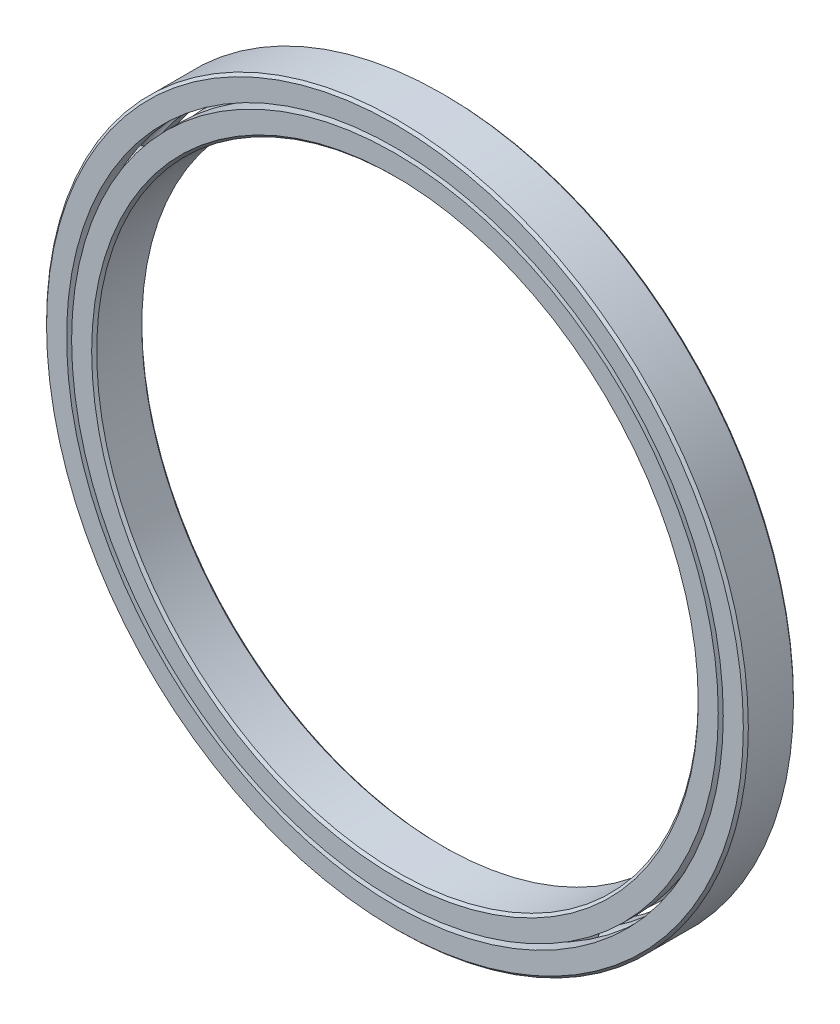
ISO-10303-21;
HEADER;
FILE_DESCRIPTION(('STEP AP214'),'2;1');
FILE_NAME('part.step','',(''),(''),'','','');
FILE_SCHEMA(('AUTOMOTIVE_DESIGN { 1 0 10303 214 1 1 1 1 }'));
ENDSEC;
DATA;
#1=APPLICATION_CONTEXT('core data for automotive mechanical design processes');
#2=APPLICATION_PROTOCOL_DEFINITION('international standard','automotive_design',2000,#1);
#3=PRODUCT_CONTEXT('',#1,'mechanical');
#4=PRODUCT('Part','Part','',(#3));
#5=PRODUCT_RELATED_PRODUCT_CATEGORY('part','',(#4));
#6=PRODUCT_DEFINITION_FORMATION('','',#4);
#7=PRODUCT_DEFINITION_CONTEXT('part definition',#1,'design');
#8=PRODUCT_DEFINITION('design','',#6,#7);
#9=PRODUCT_DEFINITION_SHAPE('','',#8);
#10=(LENGTH_UNIT() NAMED_UNIT(*) SI_UNIT(.MILLI.,.METRE.));
#11=(NAMED_UNIT(*) PLANE_ANGLE_UNIT() SI_UNIT($,.RADIAN.));
#12=(NAMED_UNIT(*) SI_UNIT($,.STERADIAN.) SOLID_ANGLE_UNIT());
#13=UNCERTAINTY_MEASURE_WITH_UNIT(LENGTH_MEASURE(1.E-05),#10,'distance_accuracy_value','');
#14=(GEOMETRIC_REPRESENTATION_CONTEXT(3) GLOBAL_UNCERTAINTY_ASSIGNED_CONTEXT((#13)) GLOBAL_UNIT_ASSIGNED_CONTEXT((#10,
#11,#12)) REPRESENTATION_CONTEXT('',''));
#15=CARTESIAN_POINT('',(0.,0.,0.));
#16=DIRECTION('',(0.,0.,1.));
#17=DIRECTION('',(1.,0.,0.));
#18=AXIS2_PLACEMENT_3D('',#15,#16,#17);
#19=CARTESIAN_POINT('',(-20.6374999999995,35.745198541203,0.));
#20=DIRECTION('',(0.,0.,1.));
#21=DIRECTION('',(-0.499999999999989,0.866025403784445,0.));
#22=AXIS2_PLACEMENT_3D('',#19,#20,#21);
#23=SPHERICAL_SURFACE('',#22,1.44638888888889);
#24=CARTESIAN_POINT('',(-20.6374999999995,35.745198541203,1.44638888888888));
#25=VERTEX_POINT('',#24);
#26=VERTEX_LOOP('',#25);
#27=FACE_BOUND('',#26,.T.);
#28=ADVANCED_FACE('F43',(#27),#23,.T.);
#29=CLOSED_SHELL('',(#28));
#30=MANIFOLD_SOLID_BREP('B2',#29);
#31=CARTESIAN_POINT('',(-35.7451985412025,20.6375000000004,0.));
#32=DIRECTION('',(0.,0.,1.));
#33=DIRECTION('',(-0.866025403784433,0.50000000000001,0.));
#34=AXIS2_PLACEMENT_3D('',#31,#32,#33);
#35=SPHERICAL_SURFACE('',#34,1.44638888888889);
#36=CARTESIAN_POINT('',(-35.7451985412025,20.6375000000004,1.44638888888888));
#37=VERTEX_POINT('',#36);
#38=VERTEX_LOOP('',#37);
#39=FACE_BOUND('',#38,.T.);
#40=ADVANCED_FACE('F63',(#39),#35,.T.);
#41=CLOSED_SHELL('',(#40));
#42=MANIFOLD_SOLID_BREP('B6',#41);
#43=CARTESIAN_POINT('',(-41.275,4.32332927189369E-13,0.));
#44=DIRECTION('',(0.,0.,1.));
#45=DIRECTION('',(-1.,0.,0.));
#46=AXIS2_PLACEMENT_3D('',#43,#44,#45);
#47=SPHERICAL_SURFACE('',#46,1.44638888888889);
#48=CARTESIAN_POINT('',(-41.275,4.32332927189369E-13,1.44638888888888));
#49=VERTEX_POINT('',#48);
#50=VERTEX_LOOP('',#49);
#51=FACE_BOUND('',#50,.T.);
#52=ADVANCED_FACE('F83',(#51),#47,.T.);
#53=CLOSED_SHELL('',(#52));
#54=MANIFOLD_SOLID_BREP('B39',#53);
#55=CARTESIAN_POINT('',(-35.7451985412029,-20.6374999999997,0.));
#56=DIRECTION('',(0.,0.,1.));
#57=DIRECTION('',(-0.866025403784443,-0.499999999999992,0.));
#58=AXIS2_PLACEMENT_3D('',#55,#56,#57);
#59=SPHERICAL_SURFACE('',#58,1.44638888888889);
#60=CARTESIAN_POINT('',(-35.7451985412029,-20.6374999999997,1.44638888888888));
#61=VERTEX_POINT('',#60);
#62=VERTEX_LOOP('',#61);
#63=FACE_BOUND('',#62,.T.);
#64=ADVANCED_FACE('F103',(#63),#59,.T.);
#65=CLOSED_SHELL('',(#64));
#66=MANIFOLD_SOLID_BREP('B59',#65);
#67=CARTESIAN_POINT('',(-20.6375000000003,-35.7451985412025,0.));
#68=DIRECTION('',(0.,0.,1.));
#69=DIRECTION('',(-0.500000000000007,-0.866025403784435,0.));
#70=AXIS2_PLACEMENT_3D('',#67,#68,#69);
#71=SPHERICAL_SURFACE('',#70,1.44638888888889);
#72=CARTESIAN_POINT('',(-20.6375000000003,-35.7451985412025,1.44638888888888));
#73=VERTEX_POINT('',#72);
#74=VERTEX_LOOP('',#73);
#75=FACE_BOUND('',#74,.T.);
#76=ADVANCED_FACE('F123',(#75),#71,.T.);
#77=CLOSED_SHELL('',(#76));
#78=MANIFOLD_SOLID_BREP('B79',#77);
#79=CARTESIAN_POINT('',(-2.88221951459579E-13,-41.275,0.));
#80=DIRECTION('',(0.,0.,1.));
#81=DIRECTION('',(0.,-1.,0.));
#82=AXIS2_PLACEMENT_3D('',#79,#80,#81);
#83=SPHERICAL_SURFACE('',#82,1.44638888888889);
#84=CARTESIAN_POINT('',(-2.88221951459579E-13,-41.275,1.44638888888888));
#85=VERTEX_POINT('',#84);
#86=VERTEX_LOOP('',#85);
#87=FACE_BOUND('',#86,.T.);
#88=ADVANCED_FACE('F143',(#87),#83,.T.);
#89=CLOSED_SHELL('',(#88));
#90=MANIFOLD_SOLID_BREP('B99',#89);
#91=CARTESIAN_POINT('',(20.6374999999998,-35.7451985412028,0.));
#92=DIRECTION('',(0.,0.,1.));
#93=DIRECTION('',(0.499999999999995,-0.866025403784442,0.));
#94=AXIS2_PLACEMENT_3D('',#91,#92,#93);
#95=SPHERICAL_SURFACE('',#94,1.44638888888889);
#96=CARTESIAN_POINT('',(20.6374999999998,-35.7451985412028,1.44638888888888));
#97=VERTEX_POINT('',#96);
#98=VERTEX_LOOP('',#97);
#99=FACE_BOUND('',#98,.T.);
#100=ADVANCED_FACE('F163',(#99),#95,.T.);
#101=CLOSED_SHELL('',(#100));
#102=MANIFOLD_SOLID_BREP('B119',#101);
#103=CARTESIAN_POINT('',(35.7451985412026,-20.6375000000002,0.));
#104=DIRECTION('',(0.,0.,1.));
#105=DIRECTION('',(0.866025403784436,-0.500000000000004,0.));
#106=AXIS2_PLACEMENT_3D('',#103,#104,#105);
#107=SPHERICAL_SURFACE('',#106,1.44638888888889);
#108=CARTESIAN_POINT('',(35.7451985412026,-20.6375000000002,1.44638888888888));
#109=VERTEX_POINT('',#108);
#110=VERTEX_LOOP('',#109);
#111=FACE_BOUND('',#110,.T.);
#112=ADVANCED_FACE('F183',(#111),#107,.T.);
#113=CLOSED_SHELL('',(#112));
#114=MANIFOLD_SOLID_BREP('B139',#113);
#115=CARTESIAN_POINT('',(41.275,-1.4411097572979E-13,0.));
#116=DIRECTION('',(0.,0.,1.));
#117=DIRECTION('',(1.,0.,0.));
#118=AXIS2_PLACEMENT_3D('',#115,#116,#117);
#119=SPHERICAL_SURFACE('',#118,1.44638888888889);
#120=CARTESIAN_POINT('',(41.275,-1.4411097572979E-13,1.44638888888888));
#121=VERTEX_POINT('',#120);
#122=VERTEX_LOOP('',#121);
#123=FACE_BOUND('',#122,.T.);
#124=ADVANCED_FACE('F203',(#123),#119,.T.);
#125=CLOSED_SHELL('',(#124));
#126=MANIFOLD_SOLID_BREP('B159',#125);
#127=CARTESIAN_POINT('',(35.7451985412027,20.6374999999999,0.));
#128=DIRECTION('',(0.,0.,1.));
#129=DIRECTION('',(0.86602540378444,0.499999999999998,0.));
#130=AXIS2_PLACEMENT_3D('',#127,#128,#129);
#131=SPHERICAL_SURFACE('',#130,1.44638888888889);
#132=CARTESIAN_POINT('',(35.7451985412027,20.6374999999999,1.44638888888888));
#133=VERTEX_POINT('',#132);
#134=VERTEX_LOOP('',#133);
#135=FACE_BOUND('',#134,.T.);
#136=ADVANCED_FACE('F223',(#135),#131,.T.);
#137=CLOSED_SHELL('',(#136));
#138=MANIFOLD_SOLID_BREP('B179',#137);
#139=CARTESIAN_POINT('',(20.6375,35.7451985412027,0.));
#140=DIRECTION('',(0.,0.,1.));
#141=DIRECTION('',(0.500000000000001,0.866025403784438,0.));
#142=AXIS2_PLACEMENT_3D('',#139,#140,#141);
#143=SPHERICAL_SURFACE('',#142,1.44638888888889);
#144=CARTESIAN_POINT('',(20.6375,35.7451985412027,1.44638888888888));
#145=VERTEX_POINT('',#144);
#146=VERTEX_LOOP('',#145);
#147=FACE_BOUND('',#146,.T.);
#148=ADVANCED_FACE('F243',(#147),#143,.T.);
#149=CLOSED_SHELL('',(#148));
#150=MANIFOLD_SOLID_BREP('B199',#149);
#151=CARTESIAN_POINT('',(0.,41.275,0.));
#152=DIRECTION('',(0.,0.,1.));
#153=DIRECTION('',(0.,1.,0.));
#154=AXIS2_PLACEMENT_3D('',#151,#152,#153);
#155=SPHERICAL_SURFACE('',#154,1.44638888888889);
#156=CARTESIAN_POINT('',(0.,41.275,1.44638888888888));
#157=VERTEX_POINT('',#156);
#158=VERTEX_LOOP('',#157);
#159=FACE_BOUND('',#158,.T.);
#160=ADVANCED_FACE('F265',(#159),#155,.T.);
#161=CLOSED_SHELL('',(#160));
#162=MANIFOLD_SOLID_BREP('B219',#161);
#163=CARTESIAN_POINT('',(0.,40.9575,3.17500000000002));
#164=DIRECTION('',(0.,0.,-1.));
#165=DIRECTION('',(-1.,0.,0.));
#166=AXIS2_PLACEMENT_3D('',#163,#164,#165);
#167=PLANE('',#166);
#168=CARTESIAN_POINT('',(0.,0.,3.17500000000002));
#169=DIRECTION('',(0.,0.,1.));
#170=DIRECTION('',(1.,0.,0.));
#171=AXIS2_PLACEMENT_3D('',#168,#169,#170);
#172=CIRCLE('',#171,38.4175);
#173=CARTESIAN_POINT('',(38.4175,0.,3.17500000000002));
#174=VERTEX_POINT('',#173);
#175=EDGE_CURVE('E312',#174,#174,#172,.T.);
#176=ORIENTED_EDGE('',*,*,#175,.F.);
#177=EDGE_LOOP('',(#176));
#178=FACE_BOUND('',#177,.T.);
#179=CARTESIAN_POINT('',(0.,0.,3.17500000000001));
#180=DIRECTION('',(0.,0.,1.));
#181=DIRECTION('',(1.,0.,0.));
#182=AXIS2_PLACEMENT_3D('',#179,#180,#181);
#183=CIRCLE('',#182,40.9575);
#184=CARTESIAN_POINT('',(40.9575,0.,3.17500000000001));
#185=VERTEX_POINT('',#184);
#186=EDGE_CURVE('E264',#185,#185,#183,.T.);
#187=ORIENTED_EDGE('',*,*,#186,.T.);
#188=EDGE_LOOP('',(#187));
#189=FACE_BOUND('',#188,.T.);
#190=ADVANCED_FACE('F284',(#178,#189),#167,.F.);
#191=CARTESIAN_POINT('',(0.,0.,3.175));
#192=DIRECTION('',(0.,0.,1.));
#193=DIRECTION('',(1.,0.,0.));
#194=AXIS2_PLACEMENT_3D('',#191,#192,#193);
#195=CYLINDRICAL_SURFACE('',#194,40.9575);
#196=ORIENTED_EDGE('',*,*,#186,.F.);
#197=EDGE_LOOP('',(#196));
#198=FACE_BOUND('',#197,.T.);
#199=CARTESIAN_POINT('',(0.,0.,1.4111111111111));
#200=DIRECTION('',(0.,0.,1.));
#201=DIRECTION('',(1.,0.,0.));
#202=AXIS2_PLACEMENT_3D('',#199,#200,#201);
#203=CIRCLE('',#202,40.9575);
#204=CARTESIAN_POINT('',(40.9575,0.,1.4111111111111));
#205=VERTEX_POINT('',#204);
#206=EDGE_CURVE('E290',#205,#205,#203,.T.);
#207=ORIENTED_EDGE('',*,*,#206,.T.);
#208=EDGE_LOOP('',(#207));
#209=FACE_BOUND('',#208,.T.);
#210=ADVANCED_FACE('F319',(#198,#209),#195,.T.);
#211=CARTESIAN_POINT('',(0.,0.,0.));
#212=DIRECTION('',(0.,0.,1.));
#213=DIRECTION('',(1.,0.,0.));
#214=AXIS2_PLACEMENT_3D('',#211,#212,#213);
#215=TOROIDAL_SURFACE('',#214,41.2749999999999,1.44638888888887);
#216=ORIENTED_EDGE('',*,*,#206,.F.);
#217=EDGE_LOOP('',(#216));
#218=FACE_BOUND('',#217,.T.);
#219=CARTESIAN_POINT('',(0.,0.,-1.41111111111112));
#220=DIRECTION('',(0.,0.,1.));
#221=DIRECTION('',(1.,0.,0.));
#222=AXIS2_PLACEMENT_3D('',#219,#220,#221);
#223=CIRCLE('',#222,40.9575);
#224=CARTESIAN_POINT('',(40.9575,0.,-1.41111111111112));
#225=VERTEX_POINT('',#224);
#226=EDGE_CURVE('E294',#225,#225,#223,.T.);
#227=ORIENTED_EDGE('',*,*,#226,.T.);
#228=EDGE_LOOP('',(#227));
#229=FACE_BOUND('',#228,.T.);
#230=ADVANCED_FACE('F323',(#218,#229),#215,.F.);
#231=CARTESIAN_POINT('',(0.,0.,3.175));
#232=DIRECTION('',(0.,0.,1.));
#233=DIRECTION('',(1.,0.,0.));
#234=AXIS2_PLACEMENT_3D('',#231,#232,#233);
#235=CYLINDRICAL_SURFACE('',#234,40.9575);
#236=ORIENTED_EDGE('',*,*,#226,.F.);
#237=EDGE_LOOP('',(#236));
#238=FACE_BOUND('',#237,.T.);
#239=CARTESIAN_POINT('',(0.,0.,-3.17500000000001));
#240=DIRECTION('',(0.,0.,1.));
#241=DIRECTION('',(1.,0.,0.));
#242=AXIS2_PLACEMENT_3D('',#239,#240,#241);
#243=CIRCLE('',#242,40.9575);
#244=CARTESIAN_POINT('',(40.9575,0.,-3.17500000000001));
#245=VERTEX_POINT('',#244);
#246=EDGE_CURVE('E298',#245,#245,#243,.T.);
#247=ORIENTED_EDGE('',*,*,#246,.T.);
#248=EDGE_LOOP('',(#247));
#249=FACE_BOUND('',#248,.T.);
#250=ADVANCED_FACE('F328',(#238,#249),#235,.T.);
#251=CARTESIAN_POINT('',(0.,38.4175,-3.17500000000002));
#252=DIRECTION('',(0.,0.,1.));
#253=DIRECTION('',(1.,0.,0.));
#254=AXIS2_PLACEMENT_3D('',#251,#252,#253);
#255=PLANE('',#254);
#256=ORIENTED_EDGE('',*,*,#246,.F.);
#257=EDGE_LOOP('',(#256));
#258=FACE_BOUND('',#257,.T.);
#259=CARTESIAN_POINT('',(0.,0.,-3.17500000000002));
#260=DIRECTION('',(0.,0.,1.));
#261=DIRECTION('',(1.,0.,0.));
#262=AXIS2_PLACEMENT_3D('',#259,#260,#261);
#263=CIRCLE('',#262,38.4175);
#264=CARTESIAN_POINT('',(38.4175,0.,-3.17500000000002));
#265=VERTEX_POINT('',#264);
#266=EDGE_CURVE('E303',#265,#265,#263,.T.);
#267=ORIENTED_EDGE('',*,*,#266,.T.);
#268=EDGE_LOOP('',(#267));
#269=FACE_BOUND('',#268,.T.);
#270=ADVANCED_FACE('F334',(#258,#269),#255,.F.);
#271=CARTESIAN_POINT('',(0.,0.,-2.85750000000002));
#272=DIRECTION('',(0.,0.,-1.));
#273=DIRECTION('',(-1.,0.,0.));
#274=AXIS2_PLACEMENT_3D('',#271,#272,#273);
#275=CONICAL_SURFACE('',#274,38.1,0.785398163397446);
#276=ORIENTED_EDGE('',*,*,#266,.F.);
#277=EDGE_LOOP('',(#276));
#278=FACE_BOUND('',#277,.T.);
#279=CARTESIAN_POINT('',(0.,0.,-2.85750000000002));
#280=DIRECTION('',(0.,0.,1.));
#281=DIRECTION('',(1.,0.,0.));
#282=AXIS2_PLACEMENT_3D('',#279,#280,#281);
#283=CIRCLE('',#282,38.1);
#284=CARTESIAN_POINT('',(38.1,0.,-2.85750000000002));
#285=VERTEX_POINT('',#284);
#286=EDGE_CURVE('E306',#285,#285,#283,.T.);
#287=ORIENTED_EDGE('',*,*,#286,.T.);
#288=EDGE_LOOP('',(#287));
#289=FACE_BOUND('',#288,.T.);
#290=ADVANCED_FACE('F338',(#278,#289),#275,.F.);
#291=CARTESIAN_POINT('',(0.,0.,3.175));
#292=DIRECTION('',(0.,0.,1.));
#293=DIRECTION('',(1.,0.,0.));
#294=AXIS2_PLACEMENT_3D('',#291,#292,#293);
#295=CYLINDRICAL_SURFACE('',#294,38.1);
#296=ORIENTED_EDGE('',*,*,#286,.F.);
#297=EDGE_LOOP('',(#296));
#298=FACE_BOUND('',#297,.T.);
#299=CARTESIAN_POINT('',(0.,0.,2.85750000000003));
#300=DIRECTION('',(0.,0.,1.));
#301=DIRECTION('',(1.,0.,0.));
#302=AXIS2_PLACEMENT_3D('',#299,#300,#301);
#303=CIRCLE('',#302,38.1);
#304=CARTESIAN_POINT('',(38.1,0.,2.85750000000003));
#305=VERTEX_POINT('',#304);
#306=EDGE_CURVE('E309',#305,#305,#303,.T.);
#307=ORIENTED_EDGE('',*,*,#306,.T.);
#308=EDGE_LOOP('',(#307));
#309=FACE_BOUND('',#308,.T.);
#310=ADVANCED_FACE('F342',(#298,#309),#295,.F.);
#311=CARTESIAN_POINT('',(0.,0.,3.17500000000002));
#312=DIRECTION('',(0.,0.,1.));
#313=DIRECTION('',(1.,0.,0.));
#314=AXIS2_PLACEMENT_3D('',#311,#312,#313);
#315=CONICAL_SURFACE('',#314,38.4175,0.785398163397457);
#316=ORIENTED_EDGE('',*,*,#306,.F.);
#317=EDGE_LOOP('',(#316));
#318=FACE_BOUND('',#317,.T.);
#319=ORIENTED_EDGE('',*,*,#175,.T.);
#320=EDGE_LOOP('',(#319));
#321=FACE_BOUND('',#320,.T.);
#322=ADVANCED_FACE('F316',(#318,#321),#315,.F.);
#323=CLOSED_SHELL('',(#190,#210,#230,#250,#270,#290,#310,#322));
#324=MANIFOLD_SOLID_BREP('B239',#323);
#325=CARTESIAN_POINT('',(0.,0.,2.8575));
#326=DIRECTION('',(0.,0.,-1.));
#327=DIRECTION('',(-1.,0.,0.));
#328=AXIS2_PLACEMENT_3D('',#325,#326,#327);
#329=CONICAL_SURFACE('',#328,44.45,0.785398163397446);
#330=CARTESIAN_POINT('',(0.,0.,3.17500000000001));
#331=DIRECTION('',(0.,0.,1.));
#332=DIRECTION('',(1.,0.,0.));
#333=AXIS2_PLACEMENT_3D('',#330,#331,#332);
#334=CIRCLE('',#333,44.1325);
#335=CARTESIAN_POINT('',(44.1325,0.,3.17500000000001));
#336=VERTEX_POINT('',#335);
#337=EDGE_CURVE('E433',#336,#336,#334,.T.);
#338=ORIENTED_EDGE('',*,*,#337,.F.);
#339=EDGE_LOOP('',(#338));
#340=FACE_BOUND('',#339,.T.);
#341=CARTESIAN_POINT('',(0.,0.,2.8575));
#342=DIRECTION('',(0.,0.,1.));
#343=DIRECTION('',(1.,0.,0.));
#344=AXIS2_PLACEMENT_3D('',#341,#342,#343);
#345=CIRCLE('',#344,44.45);
#346=CARTESIAN_POINT('',(44.45,0.,2.8575));
#347=VERTEX_POINT('',#346);
#348=EDGE_CURVE('E283',#347,#347,#345,.T.);
#349=ORIENTED_EDGE('',*,*,#348,.T.);
#350=EDGE_LOOP('',(#349));
#351=FACE_BOUND('',#350,.T.);
#352=ADVANCED_FACE('F405',(#340,#351),#329,.T.);
#353=CARTESIAN_POINT('',(0.,0.,3.175));
#354=DIRECTION('',(0.,0.,1.));
#355=DIRECTION('',(1.,0.,0.));
#356=AXIS2_PLACEMENT_3D('',#353,#354,#355);
#357=CYLINDRICAL_SURFACE('',#356,44.45);
#358=ORIENTED_EDGE('',*,*,#348,.F.);
#359=EDGE_LOOP('',(#358));
#360=FACE_BOUND('',#359,.T.);
#361=CARTESIAN_POINT('',(0.,0.,-2.85750000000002));
#362=DIRECTION('',(0.,0.,1.));
#363=DIRECTION('',(1.,0.,0.));
#364=AXIS2_PLACEMENT_3D('',#361,#362,#363);
#365=CIRCLE('',#364,44.45);
#366=CARTESIAN_POINT('',(44.45,0.,-2.85750000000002));
#367=VERTEX_POINT('',#366);
#368=EDGE_CURVE('E411',#367,#367,#365,.T.);
#369=ORIENTED_EDGE('',*,*,#368,.T.);
#370=EDGE_LOOP('',(#369));
#371=FACE_BOUND('',#370,.T.);
#372=ADVANCED_FACE('F440',(#360,#371),#357,.T.);
#373=CARTESIAN_POINT('',(0.,0.,-3.17500000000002));
#374=DIRECTION('',(0.,0.,1.));
#375=DIRECTION('',(1.,0.,0.));
#376=AXIS2_PLACEMENT_3D('',#373,#374,#375);
#377=CONICAL_SURFACE('',#376,44.1325,0.785398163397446);
#378=ORIENTED_EDGE('',*,*,#368,.F.);
#379=EDGE_LOOP('',(#378));
#380=FACE_BOUND('',#379,.T.);
#381=CARTESIAN_POINT('',(0.,0.,-3.17500000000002));
#382=DIRECTION('',(0.,0.,1.));
#383=DIRECTION('',(1.,0.,0.));
#384=AXIS2_PLACEMENT_3D('',#381,#382,#383);
#385=CIRCLE('',#384,44.1325);
#386=CARTESIAN_POINT('',(44.1325,0.,-3.17500000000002));
#387=VERTEX_POINT('',#386);
#388=EDGE_CURVE('E415',#387,#387,#385,.T.);
#389=ORIENTED_EDGE('',*,*,#388,.T.);
#390=EDGE_LOOP('',(#389));
#391=FACE_BOUND('',#390,.T.);
#392=ADVANCED_FACE('F444',(#380,#391),#377,.T.);
#393=CARTESIAN_POINT('',(0.,44.1325,-3.17500000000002));
#394=DIRECTION('',(0.,0.,1.));
#395=DIRECTION('',(1.,0.,0.));
#396=AXIS2_PLACEMENT_3D('',#393,#394,#395);
#397=PLANE('',#396);
#398=ORIENTED_EDGE('',*,*,#388,.F.);
#399=EDGE_LOOP('',(#398));
#400=FACE_BOUND('',#399,.T.);
#401=CARTESIAN_POINT('',(0.,0.,-3.17500000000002));
#402=DIRECTION('',(0.,0.,1.));
#403=DIRECTION('',(1.,0.,0.));
#404=AXIS2_PLACEMENT_3D('',#401,#402,#403);
#405=CIRCLE('',#404,41.5925);
#406=CARTESIAN_POINT('',(41.5925,0.,-3.17500000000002));
#407=VERTEX_POINT('',#406);
#408=EDGE_CURVE('E419',#407,#407,#405,.T.);
#409=ORIENTED_EDGE('',*,*,#408,.T.);
#410=EDGE_LOOP('',(#409));
#411=FACE_BOUND('',#410,.T.);
#412=ADVANCED_FACE('F449',(#400,#411),#397,.F.);
#413=CARTESIAN_POINT('',(0.,0.,3.175));
#414=DIRECTION('',(0.,0.,1.));
#415=DIRECTION('',(1.,0.,0.));
#416=AXIS2_PLACEMENT_3D('',#413,#414,#415);
#417=CYLINDRICAL_SURFACE('',#416,41.5925);
#418=ORIENTED_EDGE('',*,*,#408,.F.);
#419=EDGE_LOOP('',(#418));
#420=FACE_BOUND('',#419,.T.);
#421=CARTESIAN_POINT('',(0.,0.,-1.41111111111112));
#422=DIRECTION('',(0.,0.,1.));
#423=DIRECTION('',(1.,0.,0.));
#424=AXIS2_PLACEMENT_3D('',#421,#422,#423);
#425=CIRCLE('',#424,41.5925);
#426=CARTESIAN_POINT('',(41.5925,0.,-1.41111111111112));
#427=VERTEX_POINT('',#426);
#428=EDGE_CURVE('E424',#427,#427,#425,.T.);
#429=ORIENTED_EDGE('',*,*,#428,.T.);
#430=EDGE_LOOP('',(#429));
#431=FACE_BOUND('',#430,.T.);
#432=ADVANCED_FACE('F455',(#420,#431),#417,.F.);
#433=CARTESIAN_POINT('',(0.,0.,0.));
#434=DIRECTION('',(0.,0.,1.));
#435=DIRECTION('',(1.,0.,0.));
#436=AXIS2_PLACEMENT_3D('',#433,#434,#435);
#437=TOROIDAL_SURFACE('',#436,41.275,1.44638888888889);
#438=ORIENTED_EDGE('',*,*,#428,.F.);
#439=EDGE_LOOP('',(#438));
#440=FACE_BOUND('',#439,.T.);
#441=CARTESIAN_POINT('',(0.,0.,1.4111111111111));
#442=DIRECTION('',(0.,0.,1.));
#443=DIRECTION('',(1.,0.,0.));
#444=AXIS2_PLACEMENT_3D('',#441,#442,#443);
#445=CIRCLE('',#444,41.5925);
#446=CARTESIAN_POINT('',(41.5925,0.,1.4111111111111));
#447=VERTEX_POINT('',#446);
#448=EDGE_CURVE('E427',#447,#447,#445,.T.);
#449=ORIENTED_EDGE('',*,*,#448,.T.);
#450=EDGE_LOOP('',(#449));
#451=FACE_BOUND('',#450,.T.);
#452=ADVANCED_FACE('F459',(#440,#451),#437,.F.);
#453=CARTESIAN_POINT('',(0.,0.,3.175));
#454=DIRECTION('',(0.,0.,1.));
#455=DIRECTION('',(1.,0.,0.));
#456=AXIS2_PLACEMENT_3D('',#453,#454,#455);
#457=CYLINDRICAL_SURFACE('',#456,41.5925);
#458=ORIENTED_EDGE('',*,*,#448,.F.);
#459=EDGE_LOOP('',(#458));
#460=FACE_BOUND('',#459,.T.);
#461=CARTESIAN_POINT('',(0.,0.,3.175));
#462=DIRECTION('',(0.,0.,1.));
#463=DIRECTION('',(1.,0.,0.));
#464=AXIS2_PLACEMENT_3D('',#461,#462,#463);
#465=CIRCLE('',#464,41.5925);
#466=CARTESIAN_POINT('',(41.5925,0.,3.175));
#467=VERTEX_POINT('',#466);
#468=EDGE_CURVE('E430',#467,#467,#465,.T.);
#469=ORIENTED_EDGE('',*,*,#468,.T.);
#470=EDGE_LOOP('',(#469));
#471=FACE_BOUND('',#470,.T.);
#472=ADVANCED_FACE('F463',(#460,#471),#457,.F.);
#473=CARTESIAN_POINT('',(0.,44.1325,3.17500000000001));
#474=DIRECTION('',(0.,0.,-1.));
#475=DIRECTION('',(-1.,0.,0.));
#476=AXIS2_PLACEMENT_3D('',#473,#474,#475);
#477=PLANE('',#476);
#478=ORIENTED_EDGE('',*,*,#468,.F.);
#479=EDGE_LOOP('',(#478));
#480=FACE_BOUND('',#479,.T.);
#481=ORIENTED_EDGE('',*,*,#337,.T.);
#482=EDGE_LOOP('',(#481));
#483=FACE_BOUND('',#482,.T.);
#484=ADVANCED_FACE('F437',(#480,#483),#477,.F.);
#485=CLOSED_SHELL('',(#352,#372,#392,#412,#432,#452,#472,#484));
#486=MANIFOLD_SOLID_BREP('B259',#485);
#487=ADVANCED_BREP_SHAPE_REPRESENTATION('',(#18,#30,#42,#54,#66,#78,#90,#102,#114,#126,#138,
#150,#162,#324,#486),#14);
#488=SHAPE_DEFINITION_REPRESENTATION(#9,#487);
ENDSEC;
END-ISO-10303-21;
